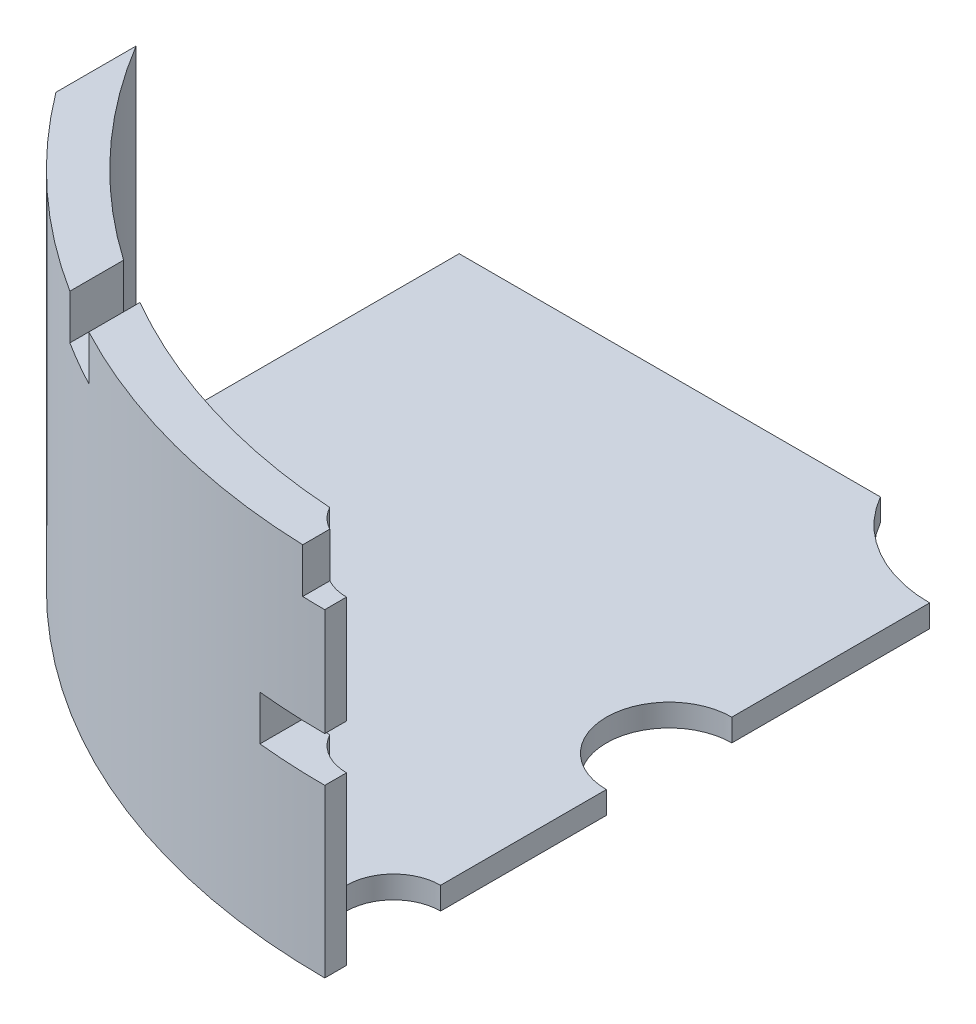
ISO-10303-21;
HEADER;
FILE_DESCRIPTION(('STEP AP214'),'2;1');
FILE_NAME('part.step','',(''),(''),'','','');
FILE_SCHEMA(('AUTOMOTIVE_DESIGN { 1 0 10303 214 1 1 1 1 }'));
ENDSEC;
DATA;
#1=APPLICATION_CONTEXT('core data for automotive mechanical design processes');
#2=APPLICATION_PROTOCOL_DEFINITION('international standard','automotive_design',2000,#1);
#3=PRODUCT_CONTEXT('',#1,'mechanical');
#4=PRODUCT('Part','Part','',(#3));
#5=PRODUCT_RELATED_PRODUCT_CATEGORY('part','',(#4));
#6=PRODUCT_DEFINITION_FORMATION('','',#4);
#7=PRODUCT_DEFINITION_CONTEXT('part definition',#1,'design');
#8=PRODUCT_DEFINITION('design','',#6,#7);
#9=PRODUCT_DEFINITION_SHAPE('','',#8);
#10=(LENGTH_UNIT() NAMED_UNIT(*) SI_UNIT(.MILLI.,.METRE.));
#11=(NAMED_UNIT(*) PLANE_ANGLE_UNIT() SI_UNIT($,.RADIAN.));
#12=(NAMED_UNIT(*) SI_UNIT($,.STERADIAN.) SOLID_ANGLE_UNIT());
#13=UNCERTAINTY_MEASURE_WITH_UNIT(LENGTH_MEASURE(1.E-05),#10,'distance_accuracy_value','');
#14=(GEOMETRIC_REPRESENTATION_CONTEXT(3) GLOBAL_UNCERTAINTY_ASSIGNED_CONTEXT((#13)) GLOBAL_UNIT_ASSIGNED_CONTEXT((#10,
#11,#12)) REPRESENTATION_CONTEXT('',''));
#15=CARTESIAN_POINT('',(0.,0.,0.));
#16=DIRECTION('',(0.,0.,1.));
#17=DIRECTION('',(1.,0.,0.));
#18=AXIS2_PLACEMENT_3D('',#15,#16,#17);
#19=CARTESIAN_POINT('',(0.,81.2,0.));
#20=DIRECTION('',(0.,1.,0.));
#21=DIRECTION('',(0.,0.,1.));
#22=AXIS2_PLACEMENT_3D('',#19,#20,#21);
#23=PLANE('',#22);
#24=DIRECTION('',(0.,0.,-1.));
#25=VECTOR('',#24,1.);
#26=CARTESIAN_POINT('',(-80.,81.2,210.2));
#27=LINE('',#26,#25);
#28=CARTESIAN_POINT('',(-80.,81.2,126.885775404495));
#29=VERTEX_POINT('',#28);
#30=CARTESIAN_POINT('',(-80.,81.2,114.891252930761));
#31=VERTEX_POINT('',#30);
#32=EDGE_CURVE('E292',#29,#31,#27,.T.);
#33=ORIENTED_EDGE('',*,*,#32,.T.);
#34=CARTESIAN_POINT('',(0.,81.2,0.));
#35=DIRECTION('',(0.,1.,0.));
#36=DIRECTION('',(0.,0.,1.));
#37=AXIS2_PLACEMENT_3D('',#34,#35,#36);
#38=CIRCLE('',#37,140.);
#39=CARTESIAN_POINT('',(-120.,81.2,72.1110255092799));
#40=VERTEX_POINT('',#39);
#41=EDGE_CURVE('E235',#40,#31,#38,.T.);
#42=ORIENTED_EDGE('',*,*,#41,.F.);
#43=DIRECTION('',(0.,0.,1.));
#44=VECTOR('',#43,1.);
#45=CARTESIAN_POINT('',(-120.,81.2,0.));
#46=LINE('',#45,#44);
#47=CARTESIAN_POINT('',(-120.,81.2,89.9999999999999));
#48=VERTEX_POINT('',#47);
#49=EDGE_CURVE('E239',#40,#48,#46,.T.);
#50=ORIENTED_EDGE('',*,*,#49,.T.);
#51=CARTESIAN_POINT('',(0.,81.2,0.));
#52=DIRECTION('',(0.,1.,0.));
#53=DIRECTION('',(0.,0.,1.));
#54=AXIS2_PLACEMENT_3D('',#51,#52,#53);
#55=CIRCLE('',#54,150.);
#56=EDGE_CURVE('E243',#48,#29,#55,.T.);
#57=ORIENTED_EDGE('',*,*,#56,.T.);
#58=EDGE_LOOP('',(#33,#42,#50,#57));
#59=FACE_BOUND('',#58,.T.);
#60=ADVANCED_FACE('F34',(#59),#23,.T.);
#61=CARTESIAN_POINT('',(0.,5.,0.));
#62=DIRECTION('',(0.,-1.,0.));
#63=DIRECTION('',(0.,0.,-1.));
#64=AXIS2_PLACEMENT_3D('',#61,#62,#63);
#65=CYLINDRICAL_SURFACE('',#64,150.);
#66=CARTESIAN_POINT('',(0.,0.,0.));
#67=DIRECTION('',(0.,1.,0.));
#68=DIRECTION('',(0.,0.,1.));
#69=AXIS2_PLACEMENT_3D('',#66,#67,#68);
#70=CIRCLE('',#69,150.);
#71=CARTESIAN_POINT('',(-120.,0.,89.9999999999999));
#72=VERTEX_POINT('',#71);
#73=CARTESIAN_POINT('',(0.,0.,150.));
#74=VERTEX_POINT('',#73);
#75=EDGE_CURVE('E405',#72,#74,#70,.T.);
#76=ORIENTED_EDGE('',*,*,#75,.T.);
#77=DIRECTION('',(0.,-1.,0.));
#78=VECTOR('',#77,1.);
#79=CARTESIAN_POINT('',(0.,5.,150.));
#80=LINE('',#79,#78);
#81=CARTESIAN_POINT('',(0.,37.2404509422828,150.));
#82=VERTEX_POINT('',#81);
#83=EDGE_CURVE('E203',#74,#82,#80,.F.);
#84=ORIENTED_EDGE('',*,*,#83,.T.);
#85=CARTESIAN_POINT('',(0.,37.2404509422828,0.));
#86=DIRECTION('',(0.,1.,0.));
#87=DIRECTION('',(0.,0.,1.));
#88=AXIS2_PLACEMENT_3D('',#85,#86,#87);
#89=CIRCLE('',#88,150.);
#90=CARTESIAN_POINT('',(-15.24,37.2404509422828,149.223799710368));
#91=VERTEX_POINT('',#90);
#92=EDGE_CURVE('E222',#91,#82,#89,.T.);
#93=ORIENTED_EDGE('',*,*,#92,.F.);
#94=DIRECTION('',(0.,-1.,0.));
#95=VECTOR('',#94,1.);
#96=CARTESIAN_POINT('',(-15.24,5.,149.223799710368));
#97=LINE('',#96,#95);
#98=CARTESIAN_POINT('',(-15.24,47.2404509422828,149.223799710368));
#99=VERTEX_POINT('',#98);
#100=EDGE_CURVE('E225',#99,#91,#97,.T.);
#101=ORIENTED_EDGE('',*,*,#100,.F.);
#102=CARTESIAN_POINT('',(0.,47.2404509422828,0.));
#103=DIRECTION('',(0.,-1.,0.));
#104=DIRECTION('',(1.,0.,0.));
#105=AXIS2_PLACEMENT_3D('',#102,#103,#104);
#106=CIRCLE('',#105,150.);
#107=CARTESIAN_POINT('',(0.,47.2404509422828,150.));
#108=VERTEX_POINT('',#107);
#109=EDGE_CURVE('E200',#108,#99,#106,.T.);
#110=ORIENTED_EDGE('',*,*,#109,.F.);
#111=CARTESIAN_POINT('',(0.,71.2,150.));
#112=VERTEX_POINT('',#111);
#113=EDGE_CURVE('E185',#108,#112,#80,.F.);
#114=ORIENTED_EDGE('',*,*,#113,.T.);
#115=CARTESIAN_POINT('',(0.,71.2,0.));
#116=DIRECTION('',(0.,1.,0.));
#117=DIRECTION('',(0.,0.,1.));
#118=AXIS2_PLACEMENT_3D('',#115,#116,#117);
#119=CIRCLE('',#118,150.);
#120=CARTESIAN_POINT('',(-5.,71.2,149.916643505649));
#121=VERTEX_POINT('',#120);
#122=EDGE_CURVE('E198',#121,#112,#119,.T.);
#123=ORIENTED_EDGE('',*,*,#122,.F.);
#124=DIRECTION('',(0.,-1.,0.));
#125=VECTOR('',#124,1.);
#126=CARTESIAN_POINT('',(-4.99999999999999,5.,149.916643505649));
#127=LINE('',#126,#125);
#128=CARTESIAN_POINT('',(-5.,81.2,149.916643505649));
#129=VERTEX_POINT('',#128);
#130=EDGE_CURVE('E209',#129,#121,#127,.T.);
#131=ORIENTED_EDGE('',*,*,#130,.F.);
#132=CARTESIAN_POINT('',(-70.,81.2,132.664991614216));
#133=VERTEX_POINT('',#132);
#134=EDGE_CURVE('E242',#133,#129,#55,.T.);
#135=ORIENTED_EDGE('',*,*,#134,.F.);
#136=DIRECTION('',(0.,-1.,0.));
#137=VECTOR('',#136,1.);
#138=CARTESIAN_POINT('',(-70.,5.,132.664991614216));
#139=LINE('',#138,#137);
#140=CARTESIAN_POINT('',(-70.,71.2,132.664991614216));
#141=VERTEX_POINT('',#140);
#142=EDGE_CURVE('E320',#133,#141,#139,.T.);
#143=ORIENTED_EDGE('',*,*,#142,.T.);
#144=CARTESIAN_POINT('',(0.,71.2,0.));
#145=DIRECTION('',(0.,-1.,0.));
#146=DIRECTION('',(0.,0.,-1.));
#147=AXIS2_PLACEMENT_3D('',#144,#145,#146);
#148=CIRCLE('',#147,150.);
#149=CARTESIAN_POINT('',(-80.,71.2,126.885775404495));
#150=VERTEX_POINT('',#149);
#151=EDGE_CURVE('E317',#141,#150,#148,.T.);
#152=ORIENTED_EDGE('',*,*,#151,.T.);
#153=DIRECTION('',(0.,-1.,0.));
#154=VECTOR('',#153,1.);
#155=CARTESIAN_POINT('',(-80.,5.,126.885775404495));
#156=LINE('',#155,#154);
#157=EDGE_CURVE('E315',#150,#29,#156,.F.);
#158=ORIENTED_EDGE('',*,*,#157,.T.);
#159=ORIENTED_EDGE('',*,*,#56,.F.);
#160=DIRECTION('',(0.,1.,0.));
#161=VECTOR('',#160,1.);
#162=CARTESIAN_POINT('',(-120.,-5.,89.9999999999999));
#163=LINE('',#162,#161);
#164=EDGE_CURVE('E312',#72,#48,#163,.T.);
#165=ORIENTED_EDGE('',*,*,#164,.F.);
#166=EDGE_LOOP('',(#76,#84,#93,#101,#110,#114,#123,#131,#135,#143,#152,#158,#159,#165));
#167=FACE_BOUND('',#166,.T.);
#168=ADVANCED_FACE('F196',(#167),#65,.T.);
#169=CARTESIAN_POINT('',(0.,-5.,134.640586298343));
#170=DIRECTION('',(0.,1.,0.));
#171=DIRECTION('',(0.,0.,1.));
#172=AXIS2_PLACEMENT_3D('',#169,#170,#171);
#173=CYLINDRICAL_SURFACE('',#172,10.5);
#174=CARTESIAN_POINT('',(0.,71.2,134.640586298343));
#175=DIRECTION('',(0.,1.,0.));
#176=DIRECTION('',(0.,0.,1.));
#177=AXIS2_PLACEMENT_3D('',#174,#175,#176);
#178=CIRCLE('',#177,10.5);
#179=CARTESIAN_POINT('',(0.,71.2,145.140586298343));
#180=VERTEX_POINT('',#179);
#181=CARTESIAN_POINT('',(-5.,71.2,143.873678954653));
#182=VERTEX_POINT('',#181);
#183=EDGE_CURVE('E281',#180,#182,#178,.F.);
#184=ORIENTED_EDGE('',*,*,#183,.F.);
#185=DIRECTION('',(0.,1.,0.));
#186=VECTOR('',#185,1.);
#187=CARTESIAN_POINT('',(0.,-5.,145.140586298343));
#188=LINE('',#187,#186);
#189=CARTESIAN_POINT('',(0.,47.2404509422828,145.140586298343));
#190=VERTEX_POINT('',#189);
#191=EDGE_CURVE('E188',#180,#190,#188,.F.);
#192=ORIENTED_EDGE('',*,*,#191,.T.);
#193=CARTESIAN_POINT('',(0.,47.2404509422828,134.640586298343));
#194=DIRECTION('',(0.,-1.,0.));
#195=DIRECTION('',(1.,0.,0.));
#196=AXIS2_PLACEMENT_3D('',#193,#194,#195);
#197=CIRCLE('',#196,10.5);
#198=CARTESIAN_POINT('',(-9.20218561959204,47.2404509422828,139.697243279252));
#199=VERTEX_POINT('',#198);
#200=EDGE_CURVE('E228',#199,#190,#197,.F.);
#201=ORIENTED_EDGE('',*,*,#200,.F.);
#202=DIRECTION('',(0.,-1.,0.));
#203=VECTOR('',#202,1.);
#204=CARTESIAN_POINT('',(-9.20218561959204,81.2,139.697243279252));
#205=LINE('',#204,#203);
#206=CARTESIAN_POINT('',(-9.20218561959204,81.2,139.697243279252));
#207=VERTEX_POINT('',#206);
#208=EDGE_CURVE('E256',#207,#199,#205,.T.);
#209=ORIENTED_EDGE('',*,*,#208,.F.);
#210=CARTESIAN_POINT('',(0.,81.2,134.640586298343));
#211=DIRECTION('',(0.,1.,0.));
#212=DIRECTION('',(0.,0.,1.));
#213=AXIS2_PLACEMENT_3D('',#210,#211,#212);
#214=CIRCLE('',#213,10.5);
#215=CARTESIAN_POINT('',(-5.,81.2,143.873678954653));
#216=VERTEX_POINT('',#215);
#217=EDGE_CURVE('E236',#216,#207,#214,.F.);
#218=ORIENTED_EDGE('',*,*,#217,.F.);
#219=DIRECTION('',(0.,1.,0.));
#220=VECTOR('',#219,1.);
#221=CARTESIAN_POINT('',(-4.99999999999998,-5.,143.873678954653));
#222=LINE('',#221,#220);
#223=EDGE_CURVE('E214',#182,#216,#222,.T.);
#224=ORIENTED_EDGE('',*,*,#223,.F.);
#225=EDGE_LOOP('',(#184,#192,#201,#209,#218,#224));
#226=FACE_BOUND('',#225,.T.);
#227=ADVANCED_FACE('F335',(#226),#173,.F.);
#228=DIRECTION('',(0.,0.,-1.));
#229=VECTOR('',#228,1.);
#230=CARTESIAN_POINT('',(-70.,81.2,210.2));
#231=LINE('',#230,#229);
#232=CARTESIAN_POINT('',(-70.,81.2,121.243556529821));
#233=VERTEX_POINT('',#232);
#234=EDGE_CURVE('E302',#133,#233,#231,.T.);
#235=ORIENTED_EDGE('',*,*,#234,.F.);
#236=ORIENTED_EDGE('',*,*,#134,.T.);
#237=DIRECTION('',(0.,0.,-1.));
#238=VECTOR('',#237,1.);
#239=CARTESIAN_POINT('',(-5.,81.2,0.));
#240=LINE('',#239,#238);
#241=EDGE_CURVE('E278',#129,#216,#240,.T.);
#242=ORIENTED_EDGE('',*,*,#241,.T.);
#243=ORIENTED_EDGE('',*,*,#217,.T.);
#244=EDGE_CURVE('E233',#233,#207,#38,.T.);
#245=ORIENTED_EDGE('',*,*,#244,.F.);
#246=EDGE_LOOP('',(#235,#236,#242,#243,#245));
#247=FACE_BOUND('',#246,.T.);
#248=ADVANCED_FACE('F331',(#247),#23,.T.);
#249=CARTESIAN_POINT('',(0.,37.2404509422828,134.640586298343));
#250=DIRECTION('',(0.,1.,0.));
#251=DIRECTION('',(0.,0.,1.));
#252=AXIS2_PLACEMENT_3D('',#249,#250,#251);
#253=CIRCLE('',#252,10.5);
#254=CARTESIAN_POINT('',(0.,37.2404509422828,145.140586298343));
#255=VERTEX_POINT('',#254);
#256=CARTESIAN_POINT('',(-9.20218561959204,37.2404509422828,139.697243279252));
#257=VERTEX_POINT('',#256);
#258=EDGE_CURVE('E220',#255,#257,#253,.F.);
#259=ORIENTED_EDGE('',*,*,#258,.F.);
#260=DIRECTION('',(0.,1.,0.));
#261=VECTOR('',#260,1.);
#262=CARTESIAN_POINT('',(0.,-5.,145.140586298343));
#263=LINE('',#262,#261);
#264=CARTESIAN_POINT('',(0.,0.,145.140586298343));
#265=VERTEX_POINT('',#264);
#266=EDGE_CURVE('E361',#255,#265,#263,.F.);
#267=ORIENTED_EDGE('',*,*,#266,.T.);
#268=CARTESIAN_POINT('',(0.,0.,134.640586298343));
#269=DIRECTION('',(0.,1.,0.));
#270=DIRECTION('',(0.,0.,1.));
#271=AXIS2_PLACEMENT_3D('',#268,#269,#270);
#272=CIRCLE('',#271,10.5);
#273=CARTESIAN_POINT('',(0.,0.,124.140586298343));
#274=VERTEX_POINT('',#273);
#275=EDGE_CURVE('E385',#274,#265,#272,.T.);
#276=ORIENTED_EDGE('',*,*,#275,.F.);
#277=DIRECTION('',(0.,1.,0.));
#278=VECTOR('',#277,1.);
#279=CARTESIAN_POINT('',(0.,-5.,124.140586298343));
#280=LINE('',#279,#278);
#281=CARTESIAN_POINT('',(0.,5.,124.140586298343));
#282=VERTEX_POINT('',#281);
#283=EDGE_CURVE('E303',#274,#282,#280,.T.);
#284=ORIENTED_EDGE('',*,*,#283,.T.);
#285=CARTESIAN_POINT('',(0.,5.,134.640586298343));
#286=DIRECTION('',(0.,1.,0.));
#287=DIRECTION('',(0.,0.,1.));
#288=AXIS2_PLACEMENT_3D('',#285,#286,#287);
#289=CIRCLE('',#288,10.5);
#290=CARTESIAN_POINT('',(-9.20218561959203,5.,139.697243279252));
#291=VERTEX_POINT('',#290);
#292=EDGE_CURVE('E38',#282,#291,#289,.T.);
#293=ORIENTED_EDGE('',*,*,#292,.T.);
#294=EDGE_CURVE('E259',#257,#291,#205,.T.);
#295=ORIENTED_EDGE('',*,*,#294,.F.);
#296=EDGE_LOOP('',(#259,#267,#276,#284,#293,#295));
#297=FACE_BOUND('',#296,.T.);
#298=ADVANCED_FACE('F380',(#297),#173,.F.);
#299=CARTESIAN_POINT('',(0.,81.2,0.));
#300=DIRECTION('',(0.,-1.,0.));
#301=DIRECTION('',(0.,0.,-1.));
#302=AXIS2_PLACEMENT_3D('',#299,#300,#301);
#303=CYLINDRICAL_SURFACE('',#302,140.);
#304=DIRECTION('',(0.,-1.,0.));
#305=VECTOR('',#304,1.);
#306=CARTESIAN_POINT('',(-80.,81.2,114.891252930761));
#307=LINE('',#306,#305);
#308=CARTESIAN_POINT('',(-80.,71.2,114.891252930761));
#309=VERTEX_POINT('',#308);
#310=EDGE_CURVE('E44',#309,#31,#307,.F.);
#311=ORIENTED_EDGE('',*,*,#310,.F.);
#312=CARTESIAN_POINT('',(0.,71.2,0.));
#313=DIRECTION('',(0.,-1.,0.));
#314=DIRECTION('',(0.,0.,-1.));
#315=AXIS2_PLACEMENT_3D('',#312,#313,#314);
#316=CIRCLE('',#315,140.);
#317=CARTESIAN_POINT('',(-70.,71.2,121.243556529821));
#318=VERTEX_POINT('',#317);
#319=EDGE_CURVE('E285',#318,#309,#316,.T.);
#320=ORIENTED_EDGE('',*,*,#319,.F.);
#321=DIRECTION('',(0.,-1.,0.));
#322=VECTOR('',#321,1.);
#323=CARTESIAN_POINT('',(-70.,81.2,121.243556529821));
#324=LINE('',#323,#322);
#325=EDGE_CURVE('E283',#233,#318,#324,.T.);
#326=ORIENTED_EDGE('',*,*,#325,.F.);
#327=ORIENTED_EDGE('',*,*,#244,.T.);
#328=ORIENTED_EDGE('',*,*,#208,.T.);
#329=CARTESIAN_POINT('',(0.,47.2404509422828,0.));
#330=DIRECTION('',(0.,-1.,0.));
#331=DIRECTION('',(1.,0.,0.));
#332=AXIS2_PLACEMENT_3D('',#329,#330,#331);
#333=CIRCLE('',#332,140.);
#334=CARTESIAN_POINT('',(-15.24,47.2404509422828,139.168036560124));
#335=VERTEX_POINT('',#334);
#336=EDGE_CURVE('E275',#199,#335,#333,.T.);
#337=ORIENTED_EDGE('',*,*,#336,.T.);
#338=DIRECTION('',(0.,-1.,0.));
#339=VECTOR('',#338,1.);
#340=CARTESIAN_POINT('',(-15.24,81.2,139.168036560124));
#341=LINE('',#340,#339);
#342=CARTESIAN_POINT('',(-15.24,37.2404509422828,139.168036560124));
#343=VERTEX_POINT('',#342);
#344=EDGE_CURVE('E271',#335,#343,#341,.T.);
#345=ORIENTED_EDGE('',*,*,#344,.T.);
#346=CARTESIAN_POINT('',(0.,37.2404509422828,0.));
#347=DIRECTION('',(0.,1.,0.));
#348=DIRECTION('',(0.,0.,1.));
#349=AXIS2_PLACEMENT_3D('',#346,#347,#348);
#350=CIRCLE('',#349,140.);
#351=EDGE_CURVE('E268',#343,#257,#350,.T.);
#352=ORIENTED_EDGE('',*,*,#351,.T.);
#353=ORIENTED_EDGE('',*,*,#294,.T.);
#354=CARTESIAN_POINT('',(0.,5.,0.));
#355=DIRECTION('',(0.,1.,0.));
#356=DIRECTION('',(0.,0.,1.));
#357=AXIS2_PLACEMENT_3D('',#354,#355,#356);
#358=CIRCLE('',#357,140.);
#359=CARTESIAN_POINT('',(-120.,5.,72.1110255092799));
#360=VERTEX_POINT('',#359);
#361=EDGE_CURVE('E232',#360,#291,#358,.T.);
#362=ORIENTED_EDGE('',*,*,#361,.F.);
#363=DIRECTION('',(0.,-1.,0.));
#364=VECTOR('',#363,1.);
#365=CARTESIAN_POINT('',(-120.,81.2,72.1110255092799));
#366=LINE('',#365,#364);
#367=EDGE_CURVE('E246',#40,#360,#366,.T.);
#368=ORIENTED_EDGE('',*,*,#367,.F.);
#369=ORIENTED_EDGE('',*,*,#41,.T.);
#370=EDGE_LOOP('',(#311,#320,#326,#327,#328,#337,#345,#352,#353,#362,#368,#369));
#371=FACE_BOUND('',#370,.T.);
#372=ADVANCED_FACE('F305',(#371),#303,.F.);
#373=CARTESIAN_POINT('',(0.,5.,0.));
#374=DIRECTION('',(0.,1.,0.));
#375=DIRECTION('',(0.,0.,1.));
#376=AXIS2_PLACEMENT_3D('',#373,#374,#375);
#377=PLANE('',#376);
#378=DIRECTION('',(0.,0.,1.));
#379=VECTOR('',#378,1.);
#380=CARTESIAN_POINT('',(0.,5.,0.));
#381=LINE('',#380,#379);
#382=CARTESIAN_POINT('',(0.,5.,14.9999999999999));
#383=VERTEX_POINT('',#382);
#384=CARTESIAN_POINT('',(0.,5.,59.1405862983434));
#385=VERTEX_POINT('',#384);
#386=EDGE_CURVE('E59',#383,#385,#381,.T.);
#387=ORIENTED_EDGE('',*,*,#386,.F.);
#388=CARTESIAN_POINT('',(0.,5.,-15.0000000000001));
#389=DIRECTION('',(0.,1.,0.));
#390=DIRECTION('',(0.,0.,1.));
#391=AXIS2_PLACEMENT_3D('',#388,#389,#390);
#392=CIRCLE('',#391,30.);
#393=CARTESIAN_POINT('',(-25.980762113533,5.,2.0122792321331E-13));
#394=VERTEX_POINT('',#393);
#395=EDGE_CURVE('E414',#394,#383,#392,.T.);
#396=ORIENTED_EDGE('',*,*,#395,.F.);
#397=DIRECTION('',(-1.,0.,0.));
#398=VECTOR('',#397,1.);
#399=CARTESIAN_POINT('',(0.,5.,2.02066721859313E-13));
#400=LINE('',#399,#398);
#401=CARTESIAN_POINT('',(-120.,5.,2.02066721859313E-13));
#402=VERTEX_POINT('',#401);
#403=EDGE_CURVE('E401',#394,#402,#400,.T.);
#404=ORIENTED_EDGE('',*,*,#403,.T.);
#405=DIRECTION('',(0.,0.,-1.));
#406=VECTOR('',#405,1.);
#407=CARTESIAN_POINT('',(-120.,5.,0.));
#408=LINE('',#407,#406);
#409=EDGE_CURVE('E395',#360,#402,#408,.T.);
#410=ORIENTED_EDGE('',*,*,#409,.F.);
#411=ORIENTED_EDGE('',*,*,#361,.T.);
#412=ORIENTED_EDGE('',*,*,#292,.F.);
#413=CARTESIAN_POINT('',(0.,5.,87.1405862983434));
#414=VERTEX_POINT('',#413);
#415=EDGE_CURVE('E348',#414,#282,#381,.T.);
#416=ORIENTED_EDGE('',*,*,#415,.F.);
#417=CARTESIAN_POINT('',(0.,5.,73.1405862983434));
#418=DIRECTION('',(0.,1.,0.));
#419=DIRECTION('',(0.,0.,1.));
#420=AXIS2_PLACEMENT_3D('',#417,#418,#419);
#421=CIRCLE('',#420,14.);
#422=EDGE_CURVE('E249',#385,#414,#421,.T.);
#423=ORIENTED_EDGE('',*,*,#422,.F.);
#424=EDGE_LOOP('',(#387,#396,#404,#410,#411,#412,#416,#423));
#425=FACE_BOUND('',#424,.T.);
#426=ADVANCED_FACE('F421',(#425),#377,.T.);
#427=CARTESIAN_POINT('',(0.,5.,2.02066721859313E-13));
#428=DIRECTION('',(0.,0.,1.));
#429=DIRECTION('',(1.,0.,0.));
#430=AXIS2_PLACEMENT_3D('',#427,#428,#429);
#431=PLANE('',#430);
#432=ORIENTED_EDGE('',*,*,#403,.F.);
#433=DIRECTION('',(0.,1.,0.));
#434=VECTOR('',#433,1.);
#435=CARTESIAN_POINT('',(-25.980762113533,-5.,2.0122792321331E-13));
#436=LINE('',#435,#434);
#437=CARTESIAN_POINT('',(-25.980762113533,0.,2.0122792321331E-13));
#438=VERTEX_POINT('',#437);
#439=EDGE_CURVE('E415',#438,#394,#436,.T.);
#440=ORIENTED_EDGE('',*,*,#439,.F.);
#441=DIRECTION('',(-1.,0.,0.));
#442=VECTOR('',#441,1.);
#443=CARTESIAN_POINT('',(0.,0.,2.02066721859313E-13));
#444=LINE('',#443,#442);
#445=CARTESIAN_POINT('',(-120.,0.,2.02066721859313E-13));
#446=VERTEX_POINT('',#445);
#447=EDGE_CURVE('E388',#438,#446,#444,.T.);
#448=ORIENTED_EDGE('',*,*,#447,.T.);
#449=DIRECTION('',(0.,1.,0.));
#450=VECTOR('',#449,1.);
#451=CARTESIAN_POINT('',(-120.,-5.,2.02066721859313E-13));
#452=LINE('',#451,#450);
#453=EDGE_CURVE('E386',#446,#402,#452,.T.);
#454=ORIENTED_EDGE('',*,*,#453,.T.);
#455=EDGE_LOOP('',(#432,#440,#448,#454));
#456=FACE_BOUND('',#455,.T.);
#457=ADVANCED_FACE('F36',(#456),#431,.F.);
#458=CARTESIAN_POINT('',(0.,0.,0.));
#459=DIRECTION('',(0.,1.,0.));
#460=DIRECTION('',(0.,0.,1.));
#461=AXIS2_PLACEMENT_3D('',#458,#459,#460);
#462=PLANE('',#461);
#463=CARTESIAN_POINT('',(0.,0.,-15.0000000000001));
#464=DIRECTION('',(0.,1.,0.));
#465=DIRECTION('',(0.,0.,1.));
#466=AXIS2_PLACEMENT_3D('',#463,#464,#465);
#467=CIRCLE('',#466,30.);
#468=CARTESIAN_POINT('',(0.,0.,14.9999999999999));
#469=VERTEX_POINT('',#468);
#470=EDGE_CURVE('E272',#438,#469,#467,.T.);
#471=ORIENTED_EDGE('',*,*,#470,.T.);
#472=DIRECTION('',(0.,0.,1.));
#473=VECTOR('',#472,1.);
#474=CARTESIAN_POINT('',(0.,0.,0.));
#475=LINE('',#474,#473);
#476=CARTESIAN_POINT('',(0.,0.,59.1405862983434));
#477=VERTEX_POINT('',#476);
#478=EDGE_CURVE('E355',#469,#477,#475,.T.);
#479=ORIENTED_EDGE('',*,*,#478,.T.);
#480=CARTESIAN_POINT('',(0.,0.,73.1405862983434));
#481=DIRECTION('',(0.,1.,0.));
#482=DIRECTION('',(0.,0.,1.));
#483=AXIS2_PLACEMENT_3D('',#480,#481,#482);
#484=CIRCLE('',#483,14.);
#485=CARTESIAN_POINT('',(0.,0.,87.1405862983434));
#486=VERTEX_POINT('',#485);
#487=EDGE_CURVE('E412',#477,#486,#484,.T.);
#488=ORIENTED_EDGE('',*,*,#487,.T.);
#489=EDGE_CURVE('E51',#486,#274,#475,.T.);
#490=ORIENTED_EDGE('',*,*,#489,.T.);
#491=ORIENTED_EDGE('',*,*,#275,.T.);
#492=EDGE_CURVE('E358',#265,#74,#475,.T.);
#493=ORIENTED_EDGE('',*,*,#492,.T.);
#494=ORIENTED_EDGE('',*,*,#75,.F.);
#495=DIRECTION('',(0.,0.,-1.));
#496=VECTOR('',#495,1.);
#497=CARTESIAN_POINT('',(-120.,0.,0.));
#498=LINE('',#497,#496);
#499=EDGE_CURVE('E404',#72,#446,#498,.T.);
#500=ORIENTED_EDGE('',*,*,#499,.T.);
#501=ORIENTED_EDGE('',*,*,#447,.F.);
#502=EDGE_LOOP('',(#471,#479,#488,#490,#491,#493,#494,#500,#501));
#503=FACE_BOUND('',#502,.T.);
#504=ADVANCED_FACE('F425',(#503),#462,.F.);
#505=CARTESIAN_POINT('',(-120.,-5.,0.));
#506=DIRECTION('',(1.,0.,0.));
#507=DIRECTION('',(0.,0.,-1.));
#508=AXIS2_PLACEMENT_3D('',#505,#506,#507);
#509=PLANE('',#508);
#510=ORIENTED_EDGE('',*,*,#164,.T.);
#511=ORIENTED_EDGE('',*,*,#49,.F.);
#512=ORIENTED_EDGE('',*,*,#367,.T.);
#513=ORIENTED_EDGE('',*,*,#409,.T.);
#514=ORIENTED_EDGE('',*,*,#453,.F.);
#515=ORIENTED_EDGE('',*,*,#499,.F.);
#516=EDGE_LOOP('',(#510,#511,#512,#513,#514,#515));
#517=FACE_BOUND('',#516,.T.);
#518=ADVANCED_FACE('F310',(#517),#509,.F.);
#519=CARTESIAN_POINT('',(0.,-5.,-15.0000000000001));
#520=DIRECTION('',(0.,1.,0.));
#521=DIRECTION('',(0.,0.,1.));
#522=AXIS2_PLACEMENT_3D('',#519,#520,#521);
#523=CYLINDRICAL_SURFACE('',#522,30.);
#524=ORIENTED_EDGE('',*,*,#395,.T.);
#525=DIRECTION('',(0.,1.,0.));
#526=VECTOR('',#525,1.);
#527=CARTESIAN_POINT('',(0.,-5.,14.9999999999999));
#528=LINE('',#527,#526);
#529=EDGE_CURVE('E351',#383,#469,#528,.F.);
#530=ORIENTED_EDGE('',*,*,#529,.T.);
#531=ORIENTED_EDGE('',*,*,#470,.F.);
#532=ORIENTED_EDGE('',*,*,#439,.T.);
#533=EDGE_LOOP('',(#524,#530,#531,#532));
#534=FACE_BOUND('',#533,.T.);
#535=ADVANCED_FACE('F420',(#534),#523,.F.);
#536=CARTESIAN_POINT('',(0.,-5.,73.1405862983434));
#537=DIRECTION('',(0.,1.,0.));
#538=DIRECTION('',(0.,0.,1.));
#539=AXIS2_PLACEMENT_3D('',#536,#537,#538);
#540=CYLINDRICAL_SURFACE('',#539,14.);
#541=ORIENTED_EDGE('',*,*,#422,.T.);
#542=DIRECTION('',(0.,1.,0.));
#543=VECTOR('',#542,1.);
#544=CARTESIAN_POINT('',(0.,-5.,87.1405862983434));
#545=LINE('',#544,#543);
#546=EDGE_CURVE('E349',#414,#486,#545,.F.);
#547=ORIENTED_EDGE('',*,*,#546,.T.);
#548=ORIENTED_EDGE('',*,*,#487,.F.);
#549=DIRECTION('',(0.,1.,0.));
#550=VECTOR('',#549,1.);
#551=CARTESIAN_POINT('',(0.,-5.,59.1405862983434));
#552=LINE('',#551,#550);
#553=EDGE_CURVE('E356',#477,#385,#552,.T.);
#554=ORIENTED_EDGE('',*,*,#553,.T.);
#555=EDGE_LOOP('',(#541,#547,#548,#554));
#556=FACE_BOUND('',#555,.T.);
#557=ADVANCED_FACE('F489',(#556),#540,.F.);
#558=CARTESIAN_POINT('',(0.,47.2404509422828,210.2));
#559=DIRECTION('',(0.,-1.,0.));
#560=DIRECTION('',(1.,0.,0.));
#561=AXIS2_PLACEMENT_3D('',#558,#559,#560);
#562=PLANE('',#561);
#563=DIRECTION('',(0.,0.,-1.));
#564=VECTOR('',#563,1.);
#565=CARTESIAN_POINT('',(0.,47.2404509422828,210.2));
#566=LINE('',#565,#564);
#567=EDGE_CURVE('E201',#108,#190,#566,.T.);
#568=ORIENTED_EDGE('',*,*,#567,.F.);
#569=ORIENTED_EDGE('',*,*,#109,.T.);
#570=DIRECTION('',(0.,0.,-1.));
#571=VECTOR('',#570,1.);
#572=CARTESIAN_POINT('',(-15.24,47.2404509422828,210.2));
#573=LINE('',#572,#571);
#574=EDGE_CURVE('E212',#99,#335,#573,.T.);
#575=ORIENTED_EDGE('',*,*,#574,.T.);
#576=ORIENTED_EDGE('',*,*,#336,.F.);
#577=ORIENTED_EDGE('',*,*,#200,.T.);
#578=EDGE_LOOP('',(#568,#569,#575,#576,#577));
#579=FACE_BOUND('',#578,.T.);
#580=ADVANCED_FACE('F368',(#579),#562,.T.);
#581=CARTESIAN_POINT('',(-15.24,0.,210.2));
#582=DIRECTION('',(1.,0.,0.));
#583=DIRECTION('',(0.,1.,0.));
#584=AXIS2_PLACEMENT_3D('',#581,#582,#583);
#585=PLANE('',#584);
#586=ORIENTED_EDGE('',*,*,#100,.T.);
#587=DIRECTION('',(0.,0.,-1.));
#588=VECTOR('',#587,1.);
#589=CARTESIAN_POINT('',(-15.24,37.2404509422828,210.2));
#590=LINE('',#589,#588);
#591=EDGE_CURVE('E208',#91,#343,#590,.T.);
#592=ORIENTED_EDGE('',*,*,#591,.T.);
#593=ORIENTED_EDGE('',*,*,#344,.F.);
#594=ORIENTED_EDGE('',*,*,#574,.F.);
#595=EDGE_LOOP('',(#586,#592,#593,#594));
#596=FACE_BOUND('',#595,.T.);
#597=ADVANCED_FACE('F371',(#596),#585,.T.);
#598=CARTESIAN_POINT('',(0.,37.2404509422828,210.2));
#599=DIRECTION('',(0.,1.,0.));
#600=DIRECTION('',(0.,0.,1.));
#601=AXIS2_PLACEMENT_3D('',#598,#599,#600);
#602=PLANE('',#601);
#603=DIRECTION('',(0.,0.,1.));
#604=VECTOR('',#603,1.);
#605=CARTESIAN_POINT('',(0.,37.2404509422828,210.2));
#606=LINE('',#605,#604);
#607=EDGE_CURVE('E364',#255,#82,#606,.T.);
#608=ORIENTED_EDGE('',*,*,#607,.F.);
#609=ORIENTED_EDGE('',*,*,#258,.T.);
#610=ORIENTED_EDGE('',*,*,#351,.F.);
#611=ORIENTED_EDGE('',*,*,#591,.F.);
#612=ORIENTED_EDGE('',*,*,#92,.T.);
#613=EDGE_LOOP('',(#608,#609,#610,#611,#612));
#614=FACE_BOUND('',#613,.T.);
#615=ADVANCED_FACE('F376',(#614),#602,.T.);
#616=CARTESIAN_POINT('',(0.,71.2,210.2));
#617=DIRECTION('',(0.,1.,0.));
#618=DIRECTION('',(0.,0.,1.));
#619=AXIS2_PLACEMENT_3D('',#616,#617,#618);
#620=PLANE('',#619);
#621=DIRECTION('',(0.,0.,1.));
#622=VECTOR('',#621,1.);
#623=CARTESIAN_POINT('',(0.,71.2,210.2));
#624=LINE('',#623,#622);
#625=EDGE_CURVE('E11',#180,#112,#624,.T.);
#626=ORIENTED_EDGE('',*,*,#625,.F.);
#627=ORIENTED_EDGE('',*,*,#183,.T.);
#628=DIRECTION('',(0.,0.,-1.));
#629=VECTOR('',#628,1.);
#630=CARTESIAN_POINT('',(-5.,71.2,210.2));
#631=LINE('',#630,#629);
#632=EDGE_CURVE('E207',#121,#182,#631,.T.);
#633=ORIENTED_EDGE('',*,*,#632,.F.);
#634=ORIENTED_EDGE('',*,*,#122,.T.);
#635=EDGE_LOOP('',(#626,#627,#633,#634));
#636=FACE_BOUND('',#635,.T.);
#637=ADVANCED_FACE('F205',(#636),#620,.T.);
#638=CARTESIAN_POINT('',(-4.99999999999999,0.,210.2));
#639=DIRECTION('',(1.,0.,0.));
#640=DIRECTION('',(0.,1.,0.));
#641=AXIS2_PLACEMENT_3D('',#638,#639,#640);
#642=PLANE('',#641);
#643=ORIENTED_EDGE('',*,*,#130,.T.);
#644=ORIENTED_EDGE('',*,*,#632,.T.);
#645=ORIENTED_EDGE('',*,*,#223,.T.);
#646=ORIENTED_EDGE('',*,*,#241,.F.);
#647=EDGE_LOOP('',(#643,#644,#645,#646));
#648=FACE_BOUND('',#647,.T.);
#649=ADVANCED_FACE('F326',(#648),#642,.T.);
#650=CARTESIAN_POINT('',(-80.,0.,210.2));
#651=DIRECTION('',(-1.,0.,0.));
#652=DIRECTION('',(0.,0.,1.));
#653=AXIS2_PLACEMENT_3D('',#650,#651,#652);
#654=PLANE('',#653);
#655=DIRECTION('',(0.,0.,-1.));
#656=VECTOR('',#655,1.);
#657=CARTESIAN_POINT('',(-80.,71.2,210.2));
#658=LINE('',#657,#656);
#659=EDGE_CURVE('E295',#150,#309,#658,.T.);
#660=ORIENTED_EDGE('',*,*,#659,.T.);
#661=ORIENTED_EDGE('',*,*,#310,.T.);
#662=ORIENTED_EDGE('',*,*,#32,.F.);
#663=ORIENTED_EDGE('',*,*,#157,.F.);
#664=EDGE_LOOP('',(#660,#661,#662,#663));
#665=FACE_BOUND('',#664,.T.);
#666=ADVANCED_FACE('F291',(#665),#654,.F.);
#667=CARTESIAN_POINT('',(0.,71.2,210.2));
#668=DIRECTION('',(0.,-1.,0.));
#669=DIRECTION('',(0.,0.,-1.));
#670=AXIS2_PLACEMENT_3D('',#667,#668,#669);
#671=PLANE('',#670);
#672=DIRECTION('',(0.,0.,-1.));
#673=VECTOR('',#672,1.);
#674=CARTESIAN_POINT('',(-70.,71.2,210.2));
#675=LINE('',#674,#673);
#676=EDGE_CURVE('E339',#141,#318,#675,.T.);
#677=ORIENTED_EDGE('',*,*,#676,.T.);
#678=ORIENTED_EDGE('',*,*,#319,.T.);
#679=ORIENTED_EDGE('',*,*,#659,.F.);
#680=ORIENTED_EDGE('',*,*,#151,.F.);
#681=EDGE_LOOP('',(#677,#678,#679,#680));
#682=FACE_BOUND('',#681,.T.);
#683=ADVANCED_FACE('F545',(#682),#671,.F.);
#684=CARTESIAN_POINT('',(-70.,0.,210.2));
#685=DIRECTION('',(1.,0.,0.));
#686=DIRECTION('',(0.,0.,-1.));
#687=AXIS2_PLACEMENT_3D('',#684,#685,#686);
#688=PLANE('',#687);
#689=ORIENTED_EDGE('',*,*,#234,.T.);
#690=ORIENTED_EDGE('',*,*,#325,.T.);
#691=ORIENTED_EDGE('',*,*,#676,.F.);
#692=ORIENTED_EDGE('',*,*,#142,.F.);
#693=EDGE_LOOP('',(#689,#690,#691,#692));
#694=FACE_BOUND('',#693,.T.);
#695=ADVANCED_FACE('F437',(#694),#688,.F.);
#696=CARTESIAN_POINT('',(0.,-5.,0.));
#697=DIRECTION('',(-1.,0.,0.));
#698=DIRECTION('',(0.,0.,1.));
#699=AXIS2_PLACEMENT_3D('',#696,#697,#698);
#700=PLANE('',#699);
#701=ORIENTED_EDGE('',*,*,#567,.T.);
#702=ORIENTED_EDGE('',*,*,#191,.F.);
#703=ORIENTED_EDGE('',*,*,#625,.T.);
#704=ORIENTED_EDGE('',*,*,#113,.F.);
#705=EDGE_LOOP('',(#701,#702,#703,#704));
#706=FACE_BOUND('',#705,.T.);
#707=ADVANCED_FACE('F184',(#706),#700,.F.);
#708=ORIENTED_EDGE('',*,*,#266,.F.);
#709=ORIENTED_EDGE('',*,*,#607,.T.);
#710=ORIENTED_EDGE('',*,*,#83,.F.);
#711=ORIENTED_EDGE('',*,*,#492,.F.);
#712=EDGE_LOOP('',(#708,#709,#710,#711));
#713=FACE_BOUND('',#712,.T.);
#714=ADVANCED_FACE('F428',(#713),#700,.F.);
#715=ORIENTED_EDGE('',*,*,#386,.T.);
#716=ORIENTED_EDGE('',*,*,#553,.F.);
#717=ORIENTED_EDGE('',*,*,#478,.F.);
#718=ORIENTED_EDGE('',*,*,#529,.F.);
#719=EDGE_LOOP('',(#715,#716,#717,#718));
#720=FACE_BOUND('',#719,.T.);
#721=ADVANCED_FACE('F430',(#720),#700,.F.);
#722=ORIENTED_EDGE('',*,*,#489,.F.);
#723=ORIENTED_EDGE('',*,*,#546,.F.);
#724=ORIENTED_EDGE('',*,*,#415,.T.);
#725=ORIENTED_EDGE('',*,*,#283,.F.);
#726=EDGE_LOOP('',(#722,#723,#724,#725));
#727=FACE_BOUND('',#726,.T.);
#728=ADVANCED_FACE('F436',(#727),#700,.F.);
#729=CLOSED_SHELL('',(#60,#168,#227,#248,#298,#372,#426,#457,#504,#518,#535,#557,#580,#597,#615,
#637,#649,#666,#683,#695,#707,#714,#721,#728));
#730=MANIFOLD_SOLID_BREP('B2',#729);
#731=ADVANCED_BREP_SHAPE_REPRESENTATION('',(#18,#730),#14);
#732=SHAPE_DEFINITION_REPRESENTATION(#9,#731);
ENDSEC;
END-ISO-10303-21;
